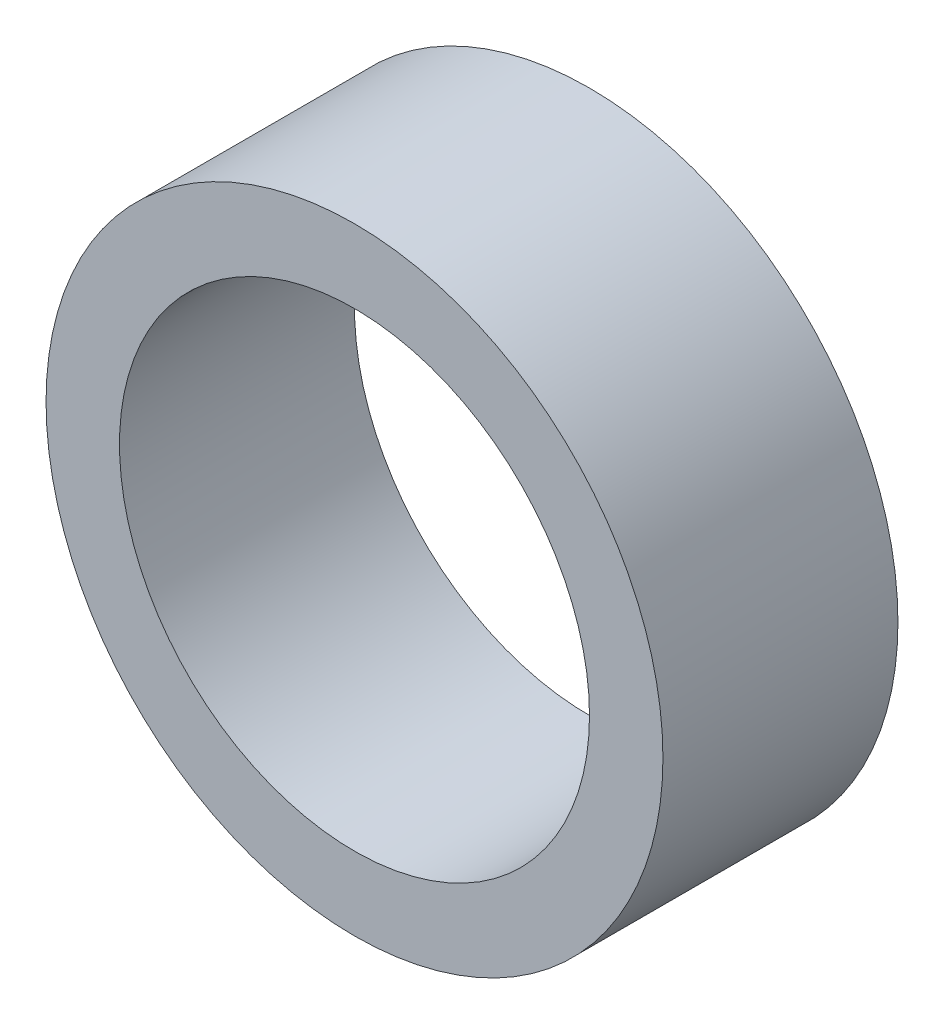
ISO-10303-21;
HEADER;
FILE_DESCRIPTION(('STEP AP214'),'2;1');
FILE_NAME('part.step','',(''),(''),'','','');
FILE_SCHEMA(('AUTOMOTIVE_DESIGN { 1 0 10303 214 1 1 1 1 }'));
ENDSEC;
DATA;
#1=APPLICATION_CONTEXT('core data for automotive mechanical design processes');
#2=APPLICATION_PROTOCOL_DEFINITION('international standard','automotive_design',2000,#1);
#3=PRODUCT_CONTEXT('',#1,'mechanical');
#4=PRODUCT('Part','Part','',(#3));
#5=PRODUCT_RELATED_PRODUCT_CATEGORY('part','',(#4));
#6=PRODUCT_DEFINITION_FORMATION('','',#4);
#7=PRODUCT_DEFINITION_CONTEXT('part definition',#1,'design');
#8=PRODUCT_DEFINITION('design','',#6,#7);
#9=PRODUCT_DEFINITION_SHAPE('','',#8);
#10=(LENGTH_UNIT() NAMED_UNIT(*) SI_UNIT(.MILLI.,.METRE.));
#11=(NAMED_UNIT(*) PLANE_ANGLE_UNIT() SI_UNIT($,.RADIAN.));
#12=(NAMED_UNIT(*) SI_UNIT($,.STERADIAN.) SOLID_ANGLE_UNIT());
#13=UNCERTAINTY_MEASURE_WITH_UNIT(LENGTH_MEASURE(1.E-05),#10,'distance_accuracy_value','');
#14=(GEOMETRIC_REPRESENTATION_CONTEXT(3) GLOBAL_UNCERTAINTY_ASSIGNED_CONTEXT((#13)) GLOBAL_UNIT_ASSIGNED_CONTEXT((#10,
#11,#12)) REPRESENTATION_CONTEXT('',''));
#15=CARTESIAN_POINT('',(0.,0.,0.));
#16=DIRECTION('',(0.,0.,1.));
#17=DIRECTION('',(1.,0.,0.));
#18=AXIS2_PLACEMENT_3D('',#15,#16,#17);
#19=CARTESIAN_POINT('',(0.,0.,8.));
#20=DIRECTION('',(0.,0.,-1.));
#21=DIRECTION('',(0.,1.,0.));
#22=AXIS2_PLACEMENT_3D('',#19,#20,#21);
#23=CYLINDRICAL_SURFACE('',#22,8.);
#24=CARTESIAN_POINT('',(0.,0.,8.));
#25=DIRECTION('',(0.,0.,-1.));
#26=DIRECTION('',(1.,0.,0.));
#27=AXIS2_PLACEMENT_3D('',#24,#25,#26);
#28=CIRCLE('',#27,8.);
#29=CARTESIAN_POINT('',(8.,0.,8.));
#30=VERTEX_POINT('',#29);
#31=EDGE_CURVE('E8',#30,#30,#28,.T.);
#32=ORIENTED_EDGE('',*,*,#31,.F.);
#33=EDGE_LOOP('',(#32));
#34=FACE_BOUND('',#33,.T.);
#35=CARTESIAN_POINT('',(0.,0.,0.));
#36=DIRECTION('',(0.,0.,-1.));
#37=DIRECTION('',(1.,0.,0.));
#38=AXIS2_PLACEMENT_3D('',#35,#36,#37);
#39=CIRCLE('',#38,8.);
#40=CARTESIAN_POINT('',(8.,0.,0.));
#41=VERTEX_POINT('',#40);
#42=EDGE_CURVE('E23',#41,#41,#39,.T.);
#43=ORIENTED_EDGE('',*,*,#42,.T.);
#44=EDGE_LOOP('',(#43));
#45=FACE_BOUND('',#44,.T.);
#46=ADVANCED_FACE('F12',(#34,#45),#23,.F.);
#47=CARTESIAN_POINT('',(0.,0.,8.));
#48=DIRECTION('',(0.,0.,-1.));
#49=DIRECTION('',(0.,1.,0.));
#50=AXIS2_PLACEMENT_3D('',#47,#48,#49);
#51=CYLINDRICAL_SURFACE('',#50,10.5);
#52=CARTESIAN_POINT('',(0.,0.,8.));
#53=DIRECTION('',(0.,0.,-1.));
#54=DIRECTION('',(1.,0.,0.));
#55=AXIS2_PLACEMENT_3D('',#52,#53,#54);
#56=CIRCLE('',#55,10.5);
#57=CARTESIAN_POINT('',(10.5,0.,8.));
#58=VERTEX_POINT('',#57);
#59=EDGE_CURVE('E19',#58,#58,#56,.T.);
#60=ORIENTED_EDGE('',*,*,#59,.T.);
#61=EDGE_LOOP('',(#60));
#62=FACE_BOUND('',#61,.T.);
#63=CARTESIAN_POINT('',(0.,0.,0.));
#64=DIRECTION('',(0.,0.,-1.));
#65=DIRECTION('',(1.,0.,0.));
#66=AXIS2_PLACEMENT_3D('',#63,#64,#65);
#67=CIRCLE('',#66,10.5);
#68=CARTESIAN_POINT('',(10.5,0.,0.));
#69=VERTEX_POINT('',#68);
#70=EDGE_CURVE('E28',#69,#69,#67,.T.);
#71=ORIENTED_EDGE('',*,*,#70,.F.);
#72=EDGE_LOOP('',(#71));
#73=FACE_BOUND('',#72,.T.);
#74=ADVANCED_FACE('F14',(#62,#73),#51,.T.);
#75=CARTESIAN_POINT('',(0.,0.,8.));
#76=DIRECTION('',(0.,0.,-1.));
#77=DIRECTION('',(0.,1.,0.));
#78=AXIS2_PLACEMENT_3D('',#75,#76,#77);
#79=PLANE('',#78);
#80=ORIENTED_EDGE('',*,*,#31,.T.);
#81=EDGE_LOOP('',(#80));
#82=FACE_BOUND('',#81,.T.);
#83=ORIENTED_EDGE('',*,*,#59,.F.);
#84=EDGE_LOOP('',(#83));
#85=FACE_BOUND('',#84,.T.);
#86=ADVANCED_FACE('F40',(#82,#85),#79,.F.);
#87=CARTESIAN_POINT('',(0.,0.,0.));
#88=DIRECTION('',(0.,0.,-1.));
#89=DIRECTION('',(0.,1.,0.));
#90=AXIS2_PLACEMENT_3D('',#87,#88,#89);
#91=PLANE('',#90);
#92=ORIENTED_EDGE('',*,*,#42,.F.);
#93=EDGE_LOOP('',(#92));
#94=FACE_BOUND('',#93,.T.);
#95=ORIENTED_EDGE('',*,*,#70,.T.);
#96=EDGE_LOOP('',(#95));
#97=FACE_BOUND('',#96,.T.);
#98=ADVANCED_FACE('F37',(#94,#97),#91,.T.);
#99=CLOSED_SHELL('',(#46,#74,#86,#98));
#100=MANIFOLD_SOLID_BREP('B1',#99);
#101=ADVANCED_BREP_SHAPE_REPRESENTATION('',(#18,#100),#14);
#102=SHAPE_DEFINITION_REPRESENTATION(#9,#101);
ENDSEC;
END-ISO-10303-21;
